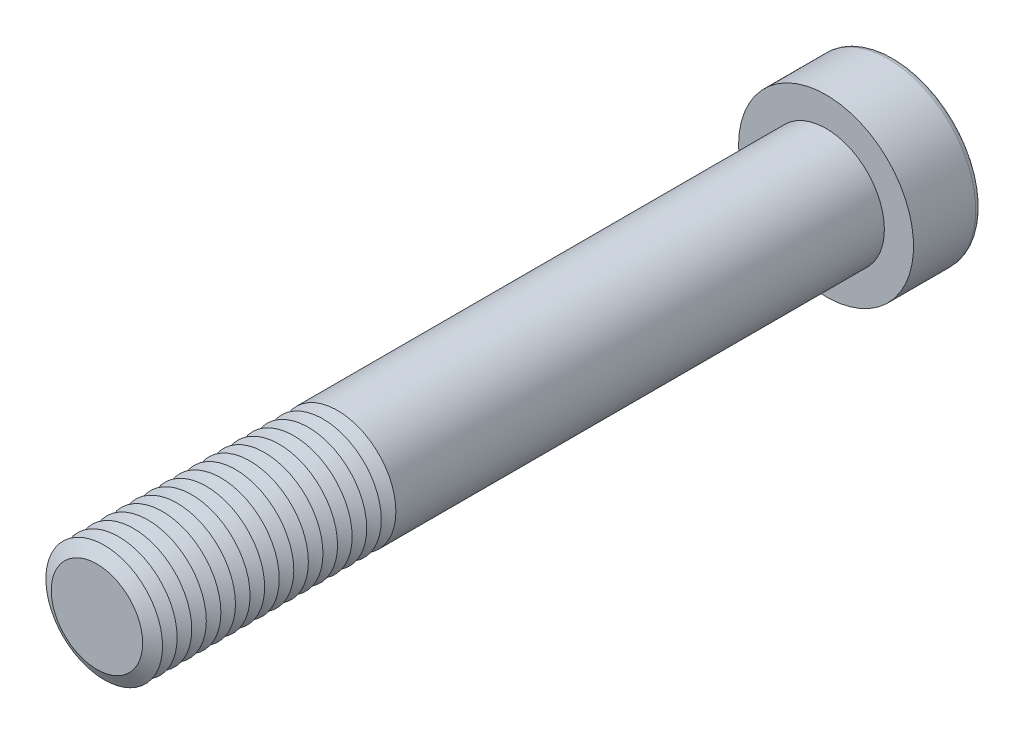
ISO-10303-21;
HEADER;
FILE_DESCRIPTION(('STEP AP214'),'2;1');
FILE_NAME('part.step','',(''),(''),'','','');
FILE_SCHEMA(('AUTOMOTIVE_DESIGN { 1 0 10303 214 1 1 1 1 }'));
ENDSEC;
DATA;
#1=APPLICATION_CONTEXT('core data for automotive mechanical design processes');
#2=APPLICATION_PROTOCOL_DEFINITION('international standard','automotive_design',2000,#1);
#3=PRODUCT_CONTEXT('',#1,'mechanical');
#4=PRODUCT('Part','Part','',(#3));
#5=PRODUCT_RELATED_PRODUCT_CATEGORY('part','',(#4));
#6=PRODUCT_DEFINITION_FORMATION('','',#4);
#7=PRODUCT_DEFINITION_CONTEXT('part definition',#1,'design');
#8=PRODUCT_DEFINITION('design','',#6,#7);
#9=PRODUCT_DEFINITION_SHAPE('','',#8);
#10=(LENGTH_UNIT() NAMED_UNIT(*) SI_UNIT(.MILLI.,.METRE.));
#11=(NAMED_UNIT(*) PLANE_ANGLE_UNIT() SI_UNIT($,.RADIAN.));
#12=(NAMED_UNIT(*) SI_UNIT($,.STERADIAN.) SOLID_ANGLE_UNIT());
#13=UNCERTAINTY_MEASURE_WITH_UNIT(LENGTH_MEASURE(1.E-05),#10,'distance_accuracy_value','');
#14=(GEOMETRIC_REPRESENTATION_CONTEXT(3) GLOBAL_UNCERTAINTY_ASSIGNED_CONTEXT((#13)) GLOBAL_UNIT_ASSIGNED_CONTEXT((#10,
#11,#12)) REPRESENTATION_CONTEXT('',''));
#15=CARTESIAN_POINT('',(0.,0.,0.));
#16=DIRECTION('',(0.,0.,1.));
#17=DIRECTION('',(1.,0.,0.));
#18=AXIS2_PLACEMENT_3D('',#15,#16,#17);
#19=CARTESIAN_POINT('',(0.,0.,139.5));
#20=DIRECTION('',(0.,0.,1.));
#21=DIRECTION('',(1.,0.,0.));
#22=AXIS2_PLACEMENT_3D('',#19,#20,#21);
#23=CONICAL_SURFACE('',#22,12.,1.0471975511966);
#24=CARTESIAN_POINT('',(0.,0.,138.));
#25=DIRECTION('',(0.,0.,1.));
#26=DIRECTION('',(1.,0.,0.));
#27=AXIS2_PLACEMENT_3D('',#24,#25,#26);
#28=CIRCLE('',#27,9.40192378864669);
#29=CARTESIAN_POINT('',(9.40192378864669,0.,138.));
#30=VERTEX_POINT('',#29);
#31=EDGE_CURVE('E313',#30,#30,#28,.T.);
#32=ORIENTED_EDGE('',*,*,#31,.T.);
#33=EDGE_LOOP('',(#32));
#34=FACE_BOUND('',#33,.T.);
#35=CARTESIAN_POINT('',(0.,0.,139.5));
#36=DIRECTION('',(0.,0.,1.));
#37=DIRECTION('',(1.,0.,0.));
#38=AXIS2_PLACEMENT_3D('',#35,#36,#37);
#39=CIRCLE('',#38,12.);
#40=CARTESIAN_POINT('',(12.,0.,139.5));
#41=VERTEX_POINT('',#40);
#42=EDGE_CURVE('E316',#41,#41,#39,.T.);
#43=ORIENTED_EDGE('',*,*,#42,.F.);
#44=EDGE_LOOP('',(#43));
#45=FACE_BOUND('',#44,.T.);
#46=ADVANCED_FACE('F39',(#34,#45),#23,.T.);
#47=CARTESIAN_POINT('',(0.,0.,138.));
#48=DIRECTION('',(0.,0.,-1.));
#49=DIRECTION('',(-1.,0.,0.));
#50=AXIS2_PLACEMENT_3D('',#47,#48,#49);
#51=CONICAL_SURFACE('',#50,9.40192378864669,1.0471975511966);
#52=CARTESIAN_POINT('',(0.,0.,136.5));
#53=DIRECTION('',(0.,0.,1.));
#54=DIRECTION('',(1.,0.,0.));
#55=AXIS2_PLACEMENT_3D('',#52,#53,#54);
#56=CIRCLE('',#55,12.);
#57=CARTESIAN_POINT('',(12.,0.,136.5));
#58=VERTEX_POINT('',#57);
#59=EDGE_CURVE('E324',#58,#58,#56,.T.);
#60=ORIENTED_EDGE('',*,*,#59,.T.);
#61=EDGE_LOOP('',(#60));
#62=FACE_BOUND('',#61,.T.);
#63=ORIENTED_EDGE('',*,*,#31,.F.);
#64=EDGE_LOOP('',(#63));
#65=FACE_BOUND('',#64,.T.);
#66=ADVANCED_FACE('F244',(#62,#65),#51,.T.);
#67=CARTESIAN_POINT('',(0.,0.,150.));
#68=DIRECTION('',(0.,0.,1.));
#69=DIRECTION('',(1.,0.,0.));
#70=AXIS2_PLACEMENT_3D('',#67,#68,#69);
#71=PLANE('',#70);
#72=CARTESIAN_POINT('',(0.,0.,150.));
#73=DIRECTION('',(0.,0.,1.));
#74=DIRECTION('',(1.,0.,0.));
#75=AXIS2_PLACEMENT_3D('',#72,#73,#74);
#76=CIRCLE('',#75,9.40192378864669);
#77=CARTESIAN_POINT('',(9.40192378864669,0.,150.));
#78=VERTEX_POINT('',#77);
#79=EDGE_CURVE('E174',#78,#78,#76,.T.);
#80=ORIENTED_EDGE('',*,*,#79,.T.);
#81=EDGE_LOOP('',(#80));
#82=FACE_BOUND('',#81,.T.);
#83=ADVANCED_FACE('F250',(#82),#71,.T.);
#84=CARTESIAN_POINT('',(0.,0.,150.));
#85=DIRECTION('',(0.,0.,-1.));
#86=DIRECTION('',(-1.,0.,0.));
#87=AXIS2_PLACEMENT_3D('',#84,#85,#86);
#88=CONICAL_SURFACE('',#87,9.40192378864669,1.0471975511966);
#89=CARTESIAN_POINT('',(0.,0.,148.5));
#90=DIRECTION('',(0.,0.,1.));
#91=DIRECTION('',(1.,0.,0.));
#92=AXIS2_PLACEMENT_3D('',#89,#90,#91);
#93=CIRCLE('',#92,12.);
#94=CARTESIAN_POINT('',(12.,0.,148.5));
#95=VERTEX_POINT('',#94);
#96=EDGE_CURVE('E290',#95,#95,#93,.T.);
#97=ORIENTED_EDGE('',*,*,#96,.T.);
#98=EDGE_LOOP('',(#97));
#99=FACE_BOUND('',#98,.T.);
#100=ORIENTED_EDGE('',*,*,#79,.F.);
#101=EDGE_LOOP('',(#100));
#102=FACE_BOUND('',#101,.T.);
#103=ADVANCED_FACE('F198',(#99,#102),#88,.T.);
#104=CARTESIAN_POINT('',(0.,0.,148.5));
#105=DIRECTION('',(0.,0.,1.));
#106=DIRECTION('',(1.,0.,0.));
#107=AXIS2_PLACEMENT_3D('',#104,#105,#106);
#108=CONICAL_SURFACE('',#107,12.,1.0471975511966);
#109=CARTESIAN_POINT('',(0.,0.,147.));
#110=DIRECTION('',(0.,0.,1.));
#111=DIRECTION('',(1.,0.,0.));
#112=AXIS2_PLACEMENT_3D('',#109,#110,#111);
#113=CIRCLE('',#112,9.40192378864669);
#114=CARTESIAN_POINT('',(9.40192378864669,0.,147.));
#115=VERTEX_POINT('',#114);
#116=EDGE_CURVE('E287',#115,#115,#113,.T.);
#117=ORIENTED_EDGE('',*,*,#116,.T.);
#118=EDGE_LOOP('',(#117));
#119=FACE_BOUND('',#118,.T.);
#120=ORIENTED_EDGE('',*,*,#96,.F.);
#121=EDGE_LOOP('',(#120));
#122=FACE_BOUND('',#121,.T.);
#123=ADVANCED_FACE('F276',(#119,#122),#108,.T.);
#124=CARTESIAN_POINT('',(0.,0.,147.));
#125=DIRECTION('',(0.,0.,-1.));
#126=DIRECTION('',(-1.,0.,0.));
#127=AXIS2_PLACEMENT_3D('',#124,#125,#126);
#128=CONICAL_SURFACE('',#127,9.40192378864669,1.0471975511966);
#129=CARTESIAN_POINT('',(0.,0.,145.5));
#130=DIRECTION('',(0.,0.,1.));
#131=DIRECTION('',(1.,0.,0.));
#132=AXIS2_PLACEMENT_3D('',#129,#130,#131);
#133=CIRCLE('',#132,12.);
#134=CARTESIAN_POINT('',(12.,0.,145.5));
#135=VERTEX_POINT('',#134);
#136=EDGE_CURVE('E299',#135,#135,#133,.T.);
#137=ORIENTED_EDGE('',*,*,#136,.T.);
#138=EDGE_LOOP('',(#137));
#139=FACE_BOUND('',#138,.T.);
#140=ORIENTED_EDGE('',*,*,#116,.F.);
#141=EDGE_LOOP('',(#140));
#142=FACE_BOUND('',#141,.T.);
#143=ADVANCED_FACE('F273',(#139,#142),#128,.T.);
#144=CARTESIAN_POINT('',(0.,0.,145.5));
#145=DIRECTION('',(0.,0.,1.));
#146=DIRECTION('',(1.,0.,0.));
#147=AXIS2_PLACEMENT_3D('',#144,#145,#146);
#148=CONICAL_SURFACE('',#147,12.,1.0471975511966);
#149=CARTESIAN_POINT('',(0.,0.,144.));
#150=DIRECTION('',(0.,0.,1.));
#151=DIRECTION('',(1.,0.,0.));
#152=AXIS2_PLACEMENT_3D('',#149,#150,#151);
#153=CIRCLE('',#152,9.40192378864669);
#154=CARTESIAN_POINT('',(9.40192378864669,0.,144.));
#155=VERTEX_POINT('',#154);
#156=EDGE_CURVE('E292',#155,#155,#153,.T.);
#157=ORIENTED_EDGE('',*,*,#156,.T.);
#158=EDGE_LOOP('',(#157));
#159=FACE_BOUND('',#158,.T.);
#160=ORIENTED_EDGE('',*,*,#136,.F.);
#161=EDGE_LOOP('',(#160));
#162=FACE_BOUND('',#161,.T.);
#163=ADVANCED_FACE('F269',(#159,#162),#148,.T.);
#164=CARTESIAN_POINT('',(0.,0.,144.));
#165=DIRECTION('',(0.,0.,-1.));
#166=DIRECTION('',(-1.,0.,0.));
#167=AXIS2_PLACEMENT_3D('',#164,#165,#166);
#168=CONICAL_SURFACE('',#167,9.40192378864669,1.0471975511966);
#169=CARTESIAN_POINT('',(0.,0.,142.5));
#170=DIRECTION('',(0.,0.,1.));
#171=DIRECTION('',(1.,0.,0.));
#172=AXIS2_PLACEMENT_3D('',#169,#170,#171);
#173=CIRCLE('',#172,12.);
#174=CARTESIAN_POINT('',(12.,0.,142.5));
#175=VERTEX_POINT('',#174);
#176=EDGE_CURVE('E309',#175,#175,#173,.T.);
#177=ORIENTED_EDGE('',*,*,#176,.T.);
#178=EDGE_LOOP('',(#177));
#179=FACE_BOUND('',#178,.T.);
#180=ORIENTED_EDGE('',*,*,#156,.F.);
#181=EDGE_LOOP('',(#180));
#182=FACE_BOUND('',#181,.T.);
#183=ADVANCED_FACE('F265',(#179,#182),#168,.T.);
#184=CARTESIAN_POINT('',(0.,0.,142.5));
#185=DIRECTION('',(0.,0.,1.));
#186=DIRECTION('',(1.,0.,0.));
#187=AXIS2_PLACEMENT_3D('',#184,#185,#186);
#188=CONICAL_SURFACE('',#187,12.,1.0471975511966);
#189=CARTESIAN_POINT('',(0.,0.,141.));
#190=DIRECTION('',(0.,0.,1.));
#191=DIRECTION('',(1.,0.,0.));
#192=AXIS2_PLACEMENT_3D('',#189,#190,#191);
#193=CIRCLE('',#192,9.40192378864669);
#194=CARTESIAN_POINT('',(9.40192378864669,0.,141.));
#195=VERTEX_POINT('',#194);
#196=EDGE_CURVE('E305',#195,#195,#193,.T.);
#197=ORIENTED_EDGE('',*,*,#196,.T.);
#198=EDGE_LOOP('',(#197));
#199=FACE_BOUND('',#198,.T.);
#200=ORIENTED_EDGE('',*,*,#176,.F.);
#201=EDGE_LOOP('',(#200));
#202=FACE_BOUND('',#201,.T.);
#203=ADVANCED_FACE('F261',(#199,#202),#188,.T.);
#204=CARTESIAN_POINT('',(0.,0.,141.));
#205=DIRECTION('',(0.,0.,-1.));
#206=DIRECTION('',(-1.,0.,0.));
#207=AXIS2_PLACEMENT_3D('',#204,#205,#206);
#208=CONICAL_SURFACE('',#207,9.40192378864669,1.0471975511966);
#209=ORIENTED_EDGE('',*,*,#42,.T.);
#210=EDGE_LOOP('',(#209));
#211=FACE_BOUND('',#210,.T.);
#212=ORIENTED_EDGE('',*,*,#196,.F.);
#213=EDGE_LOOP('',(#212));
#214=FACE_BOUND('',#213,.T.);
#215=ADVANCED_FACE('F257',(#211,#214),#208,.T.);
#216=CARTESIAN_POINT('',(0.,0.,136.5));
#217=DIRECTION('',(0.,0.,1.));
#218=DIRECTION('',(1.,0.,0.));
#219=AXIS2_PLACEMENT_3D('',#216,#217,#218);
#220=CONICAL_SURFACE('',#219,12.,1.0471975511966);
#221=CARTESIAN_POINT('',(0.,0.,135.));
#222=DIRECTION('',(0.,0.,1.));
#223=DIRECTION('',(1.,0.,0.));
#224=AXIS2_PLACEMENT_3D('',#221,#222,#223);
#225=CIRCLE('',#224,9.40192378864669);
#226=CARTESIAN_POINT('',(9.40192378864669,0.,135.));
#227=VERTEX_POINT('',#226);
#228=EDGE_CURVE('E320',#227,#227,#225,.T.);
#229=ORIENTED_EDGE('',*,*,#228,.T.);
#230=EDGE_LOOP('',(#229));
#231=FACE_BOUND('',#230,.T.);
#232=ORIENTED_EDGE('',*,*,#59,.F.);
#233=EDGE_LOOP('',(#232));
#234=FACE_BOUND('',#233,.T.);
#235=ADVANCED_FACE('F260',(#231,#234),#220,.T.);
#236=CARTESIAN_POINT('',(0.,0.,135.));
#237=DIRECTION('',(0.,0.,-1.));
#238=DIRECTION('',(-1.,0.,0.));
#239=AXIS2_PLACEMENT_3D('',#236,#237,#238);
#240=CONICAL_SURFACE('',#239,9.40192378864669,1.0471975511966);
#241=CARTESIAN_POINT('',(0.,0.,133.5));
#242=DIRECTION('',(0.,0.,1.));
#243=DIRECTION('',(1.,0.,0.));
#244=AXIS2_PLACEMENT_3D('',#241,#242,#243);
#245=CIRCLE('',#244,12.);
#246=CARTESIAN_POINT('',(12.,0.,133.5));
#247=VERTEX_POINT('',#246);
#248=EDGE_CURVE('E332',#247,#247,#245,.T.);
#249=ORIENTED_EDGE('',*,*,#248,.T.);
#250=EDGE_LOOP('',(#249));
#251=FACE_BOUND('',#250,.T.);
#252=ORIENTED_EDGE('',*,*,#228,.F.);
#253=EDGE_LOOP('',(#252));
#254=FACE_BOUND('',#253,.T.);
#255=ADVANCED_FACE('F513',(#251,#254),#240,.T.);
#256=CARTESIAN_POINT('',(0.,0.,133.5));
#257=DIRECTION('',(0.,0.,1.));
#258=DIRECTION('',(1.,0.,0.));
#259=AXIS2_PLACEMENT_3D('',#256,#257,#258);
#260=CONICAL_SURFACE('',#259,12.,1.0471975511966);
#261=CARTESIAN_POINT('',(0.,0.,132.));
#262=DIRECTION('',(0.,0.,1.));
#263=DIRECTION('',(1.,0.,0.));
#264=AXIS2_PLACEMENT_3D('',#261,#262,#263);
#265=CIRCLE('',#264,9.40192378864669);
#266=CARTESIAN_POINT('',(9.40192378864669,0.,132.));
#267=VERTEX_POINT('',#266);
#268=EDGE_CURVE('E328',#267,#267,#265,.T.);
#269=ORIENTED_EDGE('',*,*,#268,.T.);
#270=EDGE_LOOP('',(#269));
#271=FACE_BOUND('',#270,.T.);
#272=ORIENTED_EDGE('',*,*,#248,.F.);
#273=EDGE_LOOP('',(#272));
#274=FACE_BOUND('',#273,.T.);
#275=ADVANCED_FACE('F509',(#271,#274),#260,.T.);
#276=CARTESIAN_POINT('',(0.,0.,132.));
#277=DIRECTION('',(0.,0.,-1.));
#278=DIRECTION('',(-1.,0.,0.));
#279=AXIS2_PLACEMENT_3D('',#276,#277,#278);
#280=CONICAL_SURFACE('',#279,9.40192378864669,1.0471975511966);
#281=CARTESIAN_POINT('',(0.,0.,130.5));
#282=DIRECTION('',(0.,0.,1.));
#283=DIRECTION('',(1.,0.,0.));
#284=AXIS2_PLACEMENT_3D('',#281,#282,#283);
#285=CIRCLE('',#284,12.);
#286=CARTESIAN_POINT('',(12.,0.,130.5));
#287=VERTEX_POINT('',#286);
#288=EDGE_CURVE('E340',#287,#287,#285,.T.);
#289=ORIENTED_EDGE('',*,*,#288,.T.);
#290=EDGE_LOOP('',(#289));
#291=FACE_BOUND('',#290,.T.);
#292=ORIENTED_EDGE('',*,*,#268,.F.);
#293=EDGE_LOOP('',(#292));
#294=FACE_BOUND('',#293,.T.);
#295=ADVANCED_FACE('F505',(#291,#294),#280,.T.);
#296=CARTESIAN_POINT('',(0.,0.,130.5));
#297=DIRECTION('',(0.,0.,1.));
#298=DIRECTION('',(1.,0.,0.));
#299=AXIS2_PLACEMENT_3D('',#296,#297,#298);
#300=CONICAL_SURFACE('',#299,12.,1.0471975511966);
#301=CARTESIAN_POINT('',(0.,0.,129.));
#302=DIRECTION('',(0.,0.,1.));
#303=DIRECTION('',(1.,0.,0.));
#304=AXIS2_PLACEMENT_3D('',#301,#302,#303);
#305=CIRCLE('',#304,9.40192378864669);
#306=CARTESIAN_POINT('',(9.40192378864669,0.,129.));
#307=VERTEX_POINT('',#306);
#308=EDGE_CURVE('E336',#307,#307,#305,.T.);
#309=ORIENTED_EDGE('',*,*,#308,.T.);
#310=EDGE_LOOP('',(#309));
#311=FACE_BOUND('',#310,.T.);
#312=ORIENTED_EDGE('',*,*,#288,.F.);
#313=EDGE_LOOP('',(#312));
#314=FACE_BOUND('',#313,.T.);
#315=ADVANCED_FACE('F501',(#311,#314),#300,.T.);
#316=CARTESIAN_POINT('',(0.,0.,129.));
#317=DIRECTION('',(0.,0.,-1.));
#318=DIRECTION('',(-1.,0.,0.));
#319=AXIS2_PLACEMENT_3D('',#316,#317,#318);
#320=CONICAL_SURFACE('',#319,9.40192378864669,1.0471975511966);
#321=CARTESIAN_POINT('',(0.,0.,127.5));
#322=DIRECTION('',(0.,0.,1.));
#323=DIRECTION('',(1.,0.,0.));
#324=AXIS2_PLACEMENT_3D('',#321,#322,#323);
#325=CIRCLE('',#324,12.);
#326=CARTESIAN_POINT('',(12.,0.,127.5));
#327=VERTEX_POINT('',#326);
#328=EDGE_CURVE('E348',#327,#327,#325,.T.);
#329=ORIENTED_EDGE('',*,*,#328,.T.);
#330=EDGE_LOOP('',(#329));
#331=FACE_BOUND('',#330,.T.);
#332=ORIENTED_EDGE('',*,*,#308,.F.);
#333=EDGE_LOOP('',(#332));
#334=FACE_BOUND('',#333,.T.);
#335=ADVANCED_FACE('F497',(#331,#334),#320,.T.);
#336=CARTESIAN_POINT('',(0.,0.,127.5));
#337=DIRECTION('',(0.,0.,1.));
#338=DIRECTION('',(1.,0.,0.));
#339=AXIS2_PLACEMENT_3D('',#336,#337,#338);
#340=CONICAL_SURFACE('',#339,12.,1.0471975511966);
#341=CARTESIAN_POINT('',(0.,0.,126.));
#342=DIRECTION('',(0.,0.,1.));
#343=DIRECTION('',(1.,0.,0.));
#344=AXIS2_PLACEMENT_3D('',#341,#342,#343);
#345=CIRCLE('',#344,9.40192378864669);
#346=CARTESIAN_POINT('',(9.40192378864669,0.,126.));
#347=VERTEX_POINT('',#346);
#348=EDGE_CURVE('E344',#347,#347,#345,.T.);
#349=ORIENTED_EDGE('',*,*,#348,.T.);
#350=EDGE_LOOP('',(#349));
#351=FACE_BOUND('',#350,.T.);
#352=ORIENTED_EDGE('',*,*,#328,.F.);
#353=EDGE_LOOP('',(#352));
#354=FACE_BOUND('',#353,.T.);
#355=ADVANCED_FACE('F493',(#351,#354),#340,.T.);
#356=CARTESIAN_POINT('',(0.,0.,126.));
#357=DIRECTION('',(0.,0.,-1.));
#358=DIRECTION('',(-1.,0.,0.));
#359=AXIS2_PLACEMENT_3D('',#356,#357,#358);
#360=CONICAL_SURFACE('',#359,9.40192378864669,1.0471975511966);
#361=CARTESIAN_POINT('',(0.,0.,124.5));
#362=DIRECTION('',(0.,0.,1.));
#363=DIRECTION('',(1.,0.,0.));
#364=AXIS2_PLACEMENT_3D('',#361,#362,#363);
#365=CIRCLE('',#364,12.);
#366=CARTESIAN_POINT('',(12.,0.,124.5));
#367=VERTEX_POINT('',#366);
#368=EDGE_CURVE('E356',#367,#367,#365,.T.);
#369=ORIENTED_EDGE('',*,*,#368,.T.);
#370=EDGE_LOOP('',(#369));
#371=FACE_BOUND('',#370,.T.);
#372=ORIENTED_EDGE('',*,*,#348,.F.);
#373=EDGE_LOOP('',(#372));
#374=FACE_BOUND('',#373,.T.);
#375=ADVANCED_FACE('F489',(#371,#374),#360,.T.);
#376=CARTESIAN_POINT('',(0.,0.,124.5));
#377=DIRECTION('',(0.,0.,1.));
#378=DIRECTION('',(1.,0.,0.));
#379=AXIS2_PLACEMENT_3D('',#376,#377,#378);
#380=CONICAL_SURFACE('',#379,12.,1.0471975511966);
#381=CARTESIAN_POINT('',(0.,0.,123.));
#382=DIRECTION('',(0.,0.,1.));
#383=DIRECTION('',(1.,0.,0.));
#384=AXIS2_PLACEMENT_3D('',#381,#382,#383);
#385=CIRCLE('',#384,9.40192378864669);
#386=CARTESIAN_POINT('',(9.40192378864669,0.,123.));
#387=VERTEX_POINT('',#386);
#388=EDGE_CURVE('E352',#387,#387,#385,.T.);
#389=ORIENTED_EDGE('',*,*,#388,.T.);
#390=EDGE_LOOP('',(#389));
#391=FACE_BOUND('',#390,.T.);
#392=ORIENTED_EDGE('',*,*,#368,.F.);
#393=EDGE_LOOP('',(#392));
#394=FACE_BOUND('',#393,.T.);
#395=ADVANCED_FACE('F485',(#391,#394),#380,.T.);
#396=CARTESIAN_POINT('',(0.,0.,123.));
#397=DIRECTION('',(0.,0.,-1.));
#398=DIRECTION('',(-1.,0.,0.));
#399=AXIS2_PLACEMENT_3D('',#396,#397,#398);
#400=CONICAL_SURFACE('',#399,9.40192378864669,1.0471975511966);
#401=CARTESIAN_POINT('',(0.,0.,121.5));
#402=DIRECTION('',(0.,0.,1.));
#403=DIRECTION('',(1.,0.,0.));
#404=AXIS2_PLACEMENT_3D('',#401,#402,#403);
#405=CIRCLE('',#404,12.);
#406=CARTESIAN_POINT('',(12.,0.,121.5));
#407=VERTEX_POINT('',#406);
#408=EDGE_CURVE('E364',#407,#407,#405,.T.);
#409=ORIENTED_EDGE('',*,*,#408,.T.);
#410=EDGE_LOOP('',(#409));
#411=FACE_BOUND('',#410,.T.);
#412=ORIENTED_EDGE('',*,*,#388,.F.);
#413=EDGE_LOOP('',(#412));
#414=FACE_BOUND('',#413,.T.);
#415=ADVANCED_FACE('F481',(#411,#414),#400,.T.);
#416=CARTESIAN_POINT('',(0.,0.,121.5));
#417=DIRECTION('',(0.,0.,1.));
#418=DIRECTION('',(1.,0.,0.));
#419=AXIS2_PLACEMENT_3D('',#416,#417,#418);
#420=CONICAL_SURFACE('',#419,12.,1.0471975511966);
#421=CARTESIAN_POINT('',(0.,0.,120.));
#422=DIRECTION('',(0.,0.,1.));
#423=DIRECTION('',(1.,0.,0.));
#424=AXIS2_PLACEMENT_3D('',#421,#422,#423);
#425=CIRCLE('',#424,9.40192378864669);
#426=CARTESIAN_POINT('',(9.40192378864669,0.,120.));
#427=VERTEX_POINT('',#426);
#428=EDGE_CURVE('E360',#427,#427,#425,.T.);
#429=ORIENTED_EDGE('',*,*,#428,.T.);
#430=EDGE_LOOP('',(#429));
#431=FACE_BOUND('',#430,.T.);
#432=ORIENTED_EDGE('',*,*,#408,.F.);
#433=EDGE_LOOP('',(#432));
#434=FACE_BOUND('',#433,.T.);
#435=ADVANCED_FACE('F477',(#431,#434),#420,.T.);
#436=CARTESIAN_POINT('',(0.,0.,120.));
#437=DIRECTION('',(0.,0.,-1.));
#438=DIRECTION('',(-1.,0.,0.));
#439=AXIS2_PLACEMENT_3D('',#436,#437,#438);
#440=CONICAL_SURFACE('',#439,9.40192378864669,1.0471975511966);
#441=CARTESIAN_POINT('',(0.,0.,118.5));
#442=DIRECTION('',(0.,0.,1.));
#443=DIRECTION('',(1.,0.,0.));
#444=AXIS2_PLACEMENT_3D('',#441,#442,#443);
#445=CIRCLE('',#444,12.);
#446=CARTESIAN_POINT('',(12.,0.,118.5));
#447=VERTEX_POINT('',#446);
#448=EDGE_CURVE('E371',#447,#447,#445,.T.);
#449=ORIENTED_EDGE('',*,*,#448,.T.);
#450=EDGE_LOOP('',(#449));
#451=FACE_BOUND('',#450,.T.);
#452=ORIENTED_EDGE('',*,*,#428,.F.);
#453=EDGE_LOOP('',(#452));
#454=FACE_BOUND('',#453,.T.);
#455=ADVANCED_FACE('F473',(#451,#454),#440,.T.);
#456=CARTESIAN_POINT('',(0.,0.,118.5));
#457=DIRECTION('',(0.,0.,1.));
#458=DIRECTION('',(1.,0.,0.));
#459=AXIS2_PLACEMENT_3D('',#456,#457,#458);
#460=CONICAL_SURFACE('',#459,12.,1.0471975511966);
#461=CARTESIAN_POINT('',(0.,0.,117.));
#462=DIRECTION('',(0.,0.,1.));
#463=DIRECTION('',(1.,0.,0.));
#464=AXIS2_PLACEMENT_3D('',#461,#462,#463);
#465=CIRCLE('',#464,9.40192378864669);
#466=CARTESIAN_POINT('',(9.40192378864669,0.,117.));
#467=VERTEX_POINT('',#466);
#468=EDGE_CURVE('E368',#467,#467,#465,.T.);
#469=ORIENTED_EDGE('',*,*,#468,.T.);
#470=EDGE_LOOP('',(#469));
#471=FACE_BOUND('',#470,.T.);
#472=ORIENTED_EDGE('',*,*,#448,.F.);
#473=EDGE_LOOP('',(#472));
#474=FACE_BOUND('',#473,.T.);
#475=ADVANCED_FACE('F469',(#471,#474),#460,.T.);
#476=CARTESIAN_POINT('',(0.,0.,117.));
#477=DIRECTION('',(0.,0.,-1.));
#478=DIRECTION('',(-1.,0.,0.));
#479=AXIS2_PLACEMENT_3D('',#476,#477,#478);
#480=CONICAL_SURFACE('',#479,9.40192378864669,1.0471975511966);
#481=CARTESIAN_POINT('',(0.,0.,115.5));
#482=DIRECTION('',(0.,0.,1.));
#483=DIRECTION('',(1.,0.,0.));
#484=AXIS2_PLACEMENT_3D('',#481,#482,#483);
#485=CIRCLE('',#484,12.);
#486=CARTESIAN_POINT('',(12.,0.,115.5));
#487=VERTEX_POINT('',#486);
#488=EDGE_CURVE('E379',#487,#487,#485,.T.);
#489=ORIENTED_EDGE('',*,*,#488,.T.);
#490=EDGE_LOOP('',(#489));
#491=FACE_BOUND('',#490,.T.);
#492=ORIENTED_EDGE('',*,*,#468,.F.);
#493=EDGE_LOOP('',(#492));
#494=FACE_BOUND('',#493,.T.);
#495=ADVANCED_FACE('F465',(#491,#494),#480,.T.);
#496=CARTESIAN_POINT('',(0.,0.,115.5));
#497=DIRECTION('',(0.,0.,1.));
#498=DIRECTION('',(1.,0.,0.));
#499=AXIS2_PLACEMENT_3D('',#496,#497,#498);
#500=CONICAL_SURFACE('',#499,12.,1.0471975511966);
#501=CARTESIAN_POINT('',(0.,0.,114.));
#502=DIRECTION('',(0.,0.,1.));
#503=DIRECTION('',(1.,0.,0.));
#504=AXIS2_PLACEMENT_3D('',#501,#502,#503);
#505=CIRCLE('',#504,9.40192378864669);
#506=CARTESIAN_POINT('',(9.40192378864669,0.,114.));
#507=VERTEX_POINT('',#506);
#508=EDGE_CURVE('E375',#507,#507,#505,.T.);
#509=ORIENTED_EDGE('',*,*,#508,.T.);
#510=EDGE_LOOP('',(#509));
#511=FACE_BOUND('',#510,.T.);
#512=ORIENTED_EDGE('',*,*,#488,.F.);
#513=EDGE_LOOP('',(#512));
#514=FACE_BOUND('',#513,.T.);
#515=ADVANCED_FACE('F461',(#511,#514),#500,.T.);
#516=CARTESIAN_POINT('',(0.,0.,114.));
#517=DIRECTION('',(0.,0.,-1.));
#518=DIRECTION('',(-1.,0.,0.));
#519=AXIS2_PLACEMENT_3D('',#516,#517,#518);
#520=CONICAL_SURFACE('',#519,9.40192378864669,1.0471975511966);
#521=CARTESIAN_POINT('',(0.,0.,112.5));
#522=DIRECTION('',(0.,0.,1.));
#523=DIRECTION('',(1.,0.,0.));
#524=AXIS2_PLACEMENT_3D('',#521,#522,#523);
#525=CIRCLE('',#524,12.);
#526=CARTESIAN_POINT('',(12.,0.,112.5));
#527=VERTEX_POINT('',#526);
#528=EDGE_CURVE('E387',#527,#527,#525,.T.);
#529=ORIENTED_EDGE('',*,*,#528,.T.);
#530=EDGE_LOOP('',(#529));
#531=FACE_BOUND('',#530,.T.);
#532=ORIENTED_EDGE('',*,*,#508,.F.);
#533=EDGE_LOOP('',(#532));
#534=FACE_BOUND('',#533,.T.);
#535=ADVANCED_FACE('F457',(#531,#534),#520,.T.);
#536=CARTESIAN_POINT('',(0.,0.,112.5));
#537=DIRECTION('',(0.,0.,1.));
#538=DIRECTION('',(1.,0.,0.));
#539=AXIS2_PLACEMENT_3D('',#536,#537,#538);
#540=CONICAL_SURFACE('',#539,12.,1.0471975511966);
#541=CARTESIAN_POINT('',(0.,0.,111.));
#542=DIRECTION('',(0.,0.,1.));
#543=DIRECTION('',(1.,0.,0.));
#544=AXIS2_PLACEMENT_3D('',#541,#542,#543);
#545=CIRCLE('',#544,9.40192378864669);
#546=CARTESIAN_POINT('',(9.40192378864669,0.,111.));
#547=VERTEX_POINT('',#546);
#548=EDGE_CURVE('E383',#547,#547,#545,.T.);
#549=ORIENTED_EDGE('',*,*,#548,.T.);
#550=EDGE_LOOP('',(#549));
#551=FACE_BOUND('',#550,.T.);
#552=ORIENTED_EDGE('',*,*,#528,.F.);
#553=EDGE_LOOP('',(#552));
#554=FACE_BOUND('',#553,.T.);
#555=ADVANCED_FACE('F453',(#551,#554),#540,.T.);
#556=CARTESIAN_POINT('',(0.,0.,111.));
#557=DIRECTION('',(0.,0.,-1.));
#558=DIRECTION('',(-1.,0.,0.));
#559=AXIS2_PLACEMENT_3D('',#556,#557,#558);
#560=CONICAL_SURFACE('',#559,9.40192378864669,1.0471975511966);
#561=CARTESIAN_POINT('',(0.,0.,109.5));
#562=DIRECTION('',(0.,0.,1.));
#563=DIRECTION('',(1.,0.,0.));
#564=AXIS2_PLACEMENT_3D('',#561,#562,#563);
#565=CIRCLE('',#564,12.);
#566=CARTESIAN_POINT('',(12.,0.,109.5));
#567=VERTEX_POINT('',#566);
#568=EDGE_CURVE('E395',#567,#567,#565,.T.);
#569=ORIENTED_EDGE('',*,*,#568,.T.);
#570=EDGE_LOOP('',(#569));
#571=FACE_BOUND('',#570,.T.);
#572=ORIENTED_EDGE('',*,*,#548,.F.);
#573=EDGE_LOOP('',(#572));
#574=FACE_BOUND('',#573,.T.);
#575=ADVANCED_FACE('F449',(#571,#574),#560,.T.);
#576=CARTESIAN_POINT('',(0.,0.,109.5));
#577=DIRECTION('',(0.,0.,1.));
#578=DIRECTION('',(1.,0.,0.));
#579=AXIS2_PLACEMENT_3D('',#576,#577,#578);
#580=CONICAL_SURFACE('',#579,12.,1.0471975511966);
#581=CARTESIAN_POINT('',(0.,0.,108.));
#582=DIRECTION('',(0.,0.,1.));
#583=DIRECTION('',(1.,0.,0.));
#584=AXIS2_PLACEMENT_3D('',#581,#582,#583);
#585=CIRCLE('',#584,9.40192378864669);
#586=CARTESIAN_POINT('',(9.40192378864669,0.,108.));
#587=VERTEX_POINT('',#586);
#588=EDGE_CURVE('E391',#587,#587,#585,.T.);
#589=ORIENTED_EDGE('',*,*,#588,.T.);
#590=EDGE_LOOP('',(#589));
#591=FACE_BOUND('',#590,.T.);
#592=ORIENTED_EDGE('',*,*,#568,.F.);
#593=EDGE_LOOP('',(#592));
#594=FACE_BOUND('',#593,.T.);
#595=ADVANCED_FACE('F445',(#591,#594),#580,.T.);
#596=CARTESIAN_POINT('',(0.,0.,108.));
#597=DIRECTION('',(0.,0.,-1.));
#598=DIRECTION('',(-1.,0.,0.));
#599=AXIS2_PLACEMENT_3D('',#596,#597,#598);
#600=CONICAL_SURFACE('',#599,9.40192378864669,1.0471975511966);
#601=CARTESIAN_POINT('',(0.,0.,106.5));
#602=DIRECTION('',(0.,0.,1.));
#603=DIRECTION('',(1.,0.,0.));
#604=AXIS2_PLACEMENT_3D('',#601,#602,#603);
#605=CIRCLE('',#604,12.);
#606=CARTESIAN_POINT('',(12.,0.,106.5));
#607=VERTEX_POINT('',#606);
#608=EDGE_CURVE('E403',#607,#607,#605,.T.);
#609=ORIENTED_EDGE('',*,*,#608,.T.);
#610=EDGE_LOOP('',(#609));
#611=FACE_BOUND('',#610,.T.);
#612=ORIENTED_EDGE('',*,*,#588,.F.);
#613=EDGE_LOOP('',(#612));
#614=FACE_BOUND('',#613,.T.);
#615=ADVANCED_FACE('F441',(#611,#614),#600,.T.);
#616=CARTESIAN_POINT('',(0.,0.,106.5));
#617=DIRECTION('',(0.,0.,1.));
#618=DIRECTION('',(1.,0.,0.));
#619=AXIS2_PLACEMENT_3D('',#616,#617,#618);
#620=CONICAL_SURFACE('',#619,12.,1.0471975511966);
#621=CARTESIAN_POINT('',(0.,0.,105.));
#622=DIRECTION('',(0.,0.,1.));
#623=DIRECTION('',(1.,0.,0.));
#624=AXIS2_PLACEMENT_3D('',#621,#622,#623);
#625=CIRCLE('',#624,9.40192378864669);
#626=CARTESIAN_POINT('',(9.40192378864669,0.,105.));
#627=VERTEX_POINT('',#626);
#628=EDGE_CURVE('E399',#627,#627,#625,.T.);
#629=ORIENTED_EDGE('',*,*,#628,.T.);
#630=EDGE_LOOP('',(#629));
#631=FACE_BOUND('',#630,.T.);
#632=ORIENTED_EDGE('',*,*,#608,.F.);
#633=EDGE_LOOP('',(#632));
#634=FACE_BOUND('',#633,.T.);
#635=ADVANCED_FACE('F436',(#631,#634),#620,.T.);
#636=CARTESIAN_POINT('',(0.,0.,105.));
#637=DIRECTION('',(0.,0.,-1.));
#638=DIRECTION('',(-1.,0.,0.));
#639=AXIS2_PLACEMENT_3D('',#636,#637,#638);
#640=CONICAL_SURFACE('',#639,9.40192378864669,1.0471975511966);
#641=CARTESIAN_POINT('',(0.,0.,103.5));
#642=DIRECTION('',(0.,0.,1.));
#643=DIRECTION('',(1.,0.,0.));
#644=AXIS2_PLACEMENT_3D('',#641,#642,#643);
#645=CIRCLE('',#644,12.);
#646=CARTESIAN_POINT('',(12.,0.,103.5));
#647=VERTEX_POINT('',#646);
#648=EDGE_CURVE('E415',#647,#647,#645,.T.);
#649=ORIENTED_EDGE('',*,*,#648,.T.);
#650=EDGE_LOOP('',(#649));
#651=FACE_BOUND('',#650,.T.);
#652=ORIENTED_EDGE('',*,*,#628,.F.);
#653=EDGE_LOOP('',(#652));
#654=FACE_BOUND('',#653,.T.);
#655=ADVANCED_FACE('F422',(#651,#654),#640,.T.);
#656=CARTESIAN_POINT('',(0.,0.,103.5));
#657=DIRECTION('',(0.,0.,1.));
#658=DIRECTION('',(1.,0.,0.));
#659=AXIS2_PLACEMENT_3D('',#656,#657,#658);
#660=CONICAL_SURFACE('',#659,12.,1.0471975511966);
#661=CARTESIAN_POINT('',(0.,0.,102.));
#662=DIRECTION('',(0.,0.,1.));
#663=DIRECTION('',(1.,0.,0.));
#664=AXIS2_PLACEMENT_3D('',#661,#662,#663);
#665=CIRCLE('',#664,9.40192378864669);
#666=CARTESIAN_POINT('',(9.40192378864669,0.,102.));
#667=VERTEX_POINT('',#666);
#668=EDGE_CURVE('E407',#667,#667,#665,.T.);
#669=ORIENTED_EDGE('',*,*,#668,.T.);
#670=EDGE_LOOP('',(#669));
#671=FACE_BOUND('',#670,.T.);
#672=ORIENTED_EDGE('',*,*,#648,.F.);
#673=EDGE_LOOP('',(#672));
#674=FACE_BOUND('',#673,.T.);
#675=ADVANCED_FACE('F425',(#671,#674),#660,.T.);
#676=CARTESIAN_POINT('',(0.,0.,102.));
#677=DIRECTION('',(0.,0.,-1.));
#678=DIRECTION('',(-1.,0.,0.));
#679=AXIS2_PLACEMENT_3D('',#676,#677,#678);
#680=CONICAL_SURFACE('',#679,9.40192378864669,1.0471975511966);
#681=CARTESIAN_POINT('',(0.,0.,100.5));
#682=DIRECTION('',(0.,0.,1.));
#683=DIRECTION('',(1.,0.,0.));
#684=AXIS2_PLACEMENT_3D('',#681,#682,#683);
#685=CIRCLE('',#684,12.);
#686=CARTESIAN_POINT('',(12.,0.,100.5));
#687=VERTEX_POINT('',#686);
#688=EDGE_CURVE('E411',#687,#687,#685,.T.);
#689=ORIENTED_EDGE('',*,*,#688,.T.);
#690=EDGE_LOOP('',(#689));
#691=FACE_BOUND('',#690,.T.);
#692=ORIENTED_EDGE('',*,*,#668,.F.);
#693=EDGE_LOOP('',(#692));
#694=FACE_BOUND('',#693,.T.);
#695=ADVANCED_FACE('F427',(#691,#694),#680,.T.);
#696=CARTESIAN_POINT('',(0.,0.,0.25));
#697=DIRECTION('',(0.,0.,-1.));
#698=DIRECTION('',(-1.,0.,0.));
#699=AXIS2_PLACEMENT_3D('',#696,#697,#698);
#700=CONICAL_SURFACE('',#699,9.5,1.0471975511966);
#701=CARTESIAN_POINT('',(0.,0.,5.73482755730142));
#702=VERTEX_POINT('',#701);
#703=VERTEX_LOOP('',#702);
#704=FACE_BOUND('',#703,.T.);
#705=CARTESIAN_POINT('',(0.,0.,0.25));
#706=DIRECTION('',(0.,0.,-1.));
#707=DIRECTION('',(-1.,0.,0.));
#708=AXIS2_PLACEMENT_3D('',#705,#706,#707);
#709=CIRCLE('',#708,9.5);
#710=CARTESIAN_POINT('',(-8.22724133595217,4.75,0.25));
#711=VERTEX_POINT('',#710);
#712=CARTESIAN_POINT('',(0.,9.5,0.25));
#713=VERTEX_POINT('',#712);
#714=EDGE_CURVE('E149',#711,#713,#709,.T.);
#715=ORIENTED_EDGE('',*,*,#714,.T.);
#716=CARTESIAN_POINT('',(0.,0.,0.25));
#717=DIRECTION('',(0.,0.,-1.));
#718=DIRECTION('',(-1.,0.,0.));
#719=AXIS2_PLACEMENT_3D('',#716,#717,#718);
#720=CIRCLE('',#719,9.5);
#721=CARTESIAN_POINT('',(8.22724133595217,4.75,0.25));
#722=VERTEX_POINT('',#721);
#723=EDGE_CURVE('E54',#713,#722,#720,.T.);
#724=ORIENTED_EDGE('',*,*,#723,.T.);
#725=CARTESIAN_POINT('',(8.22724133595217,-4.75,0.25));
#726=VERTEX_POINT('',#725);
#727=EDGE_CURVE('E1028',#722,#726,#720,.T.);
#728=ORIENTED_EDGE('',*,*,#727,.T.);
#729=CARTESIAN_POINT('',(0.,-9.5,0.25));
#730=VERTEX_POINT('',#729);
#731=EDGE_CURVE('E1026',#726,#730,#720,.T.);
#732=ORIENTED_EDGE('',*,*,#731,.T.);
#733=CARTESIAN_POINT('',(-8.22724133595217,-4.75,0.25));
#734=VERTEX_POINT('',#733);
#735=EDGE_CURVE('E1020',#730,#734,#720,.T.);
#736=ORIENTED_EDGE('',*,*,#735,.T.);
#737=EDGE_CURVE('E1018',#734,#711,#720,.T.);
#738=ORIENTED_EDGE('',*,*,#737,.T.);
#739=EDGE_LOOP('',(#715,#724,#728,#732,#736,#738));
#740=FACE_BOUND('',#739,.T.);
#741=ADVANCED_FACE('F200',(#704,#740),#700,.F.);
#742=CARTESIAN_POINT('',(0.,0.,0.25));
#743=DIRECTION('',(0.,0.,-1.));
#744=DIRECTION('',(-1.,0.,0.));
#745=AXIS2_PLACEMENT_3D('',#742,#743,#744);
#746=PLANE('',#745);
#747=ORIENTED_EDGE('',*,*,#723,.F.);
#748=DIRECTION('',(1.,0.,0.));
#749=VECTOR('',#748,1.);
#750=CARTESIAN_POINT('',(-5.48482755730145,9.5,0.25));
#751=LINE('',#750,#749);
#752=CARTESIAN_POINT('',(5.48482755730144,9.5,0.25));
#753=VERTEX_POINT('',#752);
#754=EDGE_CURVE('E1069',#713,#753,#751,.T.);
#755=ORIENTED_EDGE('',*,*,#754,.T.);
#756=DIRECTION('',(0.5,-0.866025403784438,0.));
#757=VECTOR('',#756,1.);
#758=CARTESIAN_POINT('',(5.48482755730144,9.5,0.25));
#759=LINE('',#758,#757);
#760=EDGE_CURVE('E155',#753,#722,#759,.T.);
#761=ORIENTED_EDGE('',*,*,#760,.T.);
#762=EDGE_LOOP('',(#747,#755,#761));
#763=FACE_BOUND('',#762,.T.);
#764=ADVANCED_FACE('F608',(#763),#746,.T.);
#765=ORIENTED_EDGE('',*,*,#727,.F.);
#766=CARTESIAN_POINT('',(10.9696551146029,0.,0.25));
#767=VERTEX_POINT('',#766);
#768=EDGE_CURVE('E1063',#722,#767,#759,.T.);
#769=ORIENTED_EDGE('',*,*,#768,.T.);
#770=DIRECTION('',(-0.5,-0.866025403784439,0.));
#771=VECTOR('',#770,1.);
#772=CARTESIAN_POINT('',(10.9696551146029,0.,0.25));
#773=LINE('',#772,#771);
#774=EDGE_CURVE('E1041',#767,#726,#773,.T.);
#775=ORIENTED_EDGE('',*,*,#774,.T.);
#776=EDGE_LOOP('',(#765,#769,#775));
#777=FACE_BOUND('',#776,.T.);
#778=ADVANCED_FACE('F618',(#777),#746,.T.);
#779=ORIENTED_EDGE('',*,*,#731,.F.);
#780=CARTESIAN_POINT('',(5.48482755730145,-9.5,0.25));
#781=VERTEX_POINT('',#780);
#782=EDGE_CURVE('E1043',#726,#781,#773,.T.);
#783=ORIENTED_EDGE('',*,*,#782,.T.);
#784=DIRECTION('',(-1.,0.,0.));
#785=VECTOR('',#784,1.);
#786=CARTESIAN_POINT('',(5.48482755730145,-9.5,0.25));
#787=LINE('',#786,#785);
#788=EDGE_CURVE('E993',#781,#730,#787,.T.);
#789=ORIENTED_EDGE('',*,*,#788,.T.);
#790=EDGE_LOOP('',(#779,#783,#789));
#791=FACE_BOUND('',#790,.T.);
#792=ADVANCED_FACE('F628',(#791),#746,.T.);
#793=ORIENTED_EDGE('',*,*,#735,.F.);
#794=CARTESIAN_POINT('',(-5.48482755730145,-9.5,0.25));
#795=VERTEX_POINT('',#794);
#796=EDGE_CURVE('E1038',#730,#795,#787,.T.);
#797=ORIENTED_EDGE('',*,*,#796,.T.);
#798=DIRECTION('',(-0.5,0.866025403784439,0.));
#799=VECTOR('',#798,1.);
#800=CARTESIAN_POINT('',(-5.48482755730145,-9.5,0.25));
#801=LINE('',#800,#799);
#802=EDGE_CURVE('E1040',#795,#734,#801,.T.);
#803=ORIENTED_EDGE('',*,*,#802,.T.);
#804=EDGE_LOOP('',(#793,#797,#803));
#805=FACE_BOUND('',#804,.T.);
#806=ADVANCED_FACE('F636',(#805),#746,.T.);
#807=ORIENTED_EDGE('',*,*,#737,.F.);
#808=CARTESIAN_POINT('',(-10.9696551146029,0.,0.25));
#809=VERTEX_POINT('',#808);
#810=EDGE_CURVE('E1045',#734,#809,#801,.T.);
#811=ORIENTED_EDGE('',*,*,#810,.T.);
#812=DIRECTION('',(0.5,0.866025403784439,0.));
#813=VECTOR('',#812,1.);
#814=CARTESIAN_POINT('',(-10.9696551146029,0.,0.25));
#815=LINE('',#814,#813);
#816=EDGE_CURVE('E158',#809,#711,#815,.T.);
#817=ORIENTED_EDGE('',*,*,#816,.T.);
#818=EDGE_LOOP('',(#807,#811,#817));
#819=FACE_BOUND('',#818,.T.);
#820=ADVANCED_FACE('F230',(#819),#746,.T.);
#821=ORIENTED_EDGE('',*,*,#714,.F.);
#822=CARTESIAN_POINT('',(-5.48482755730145,9.5,0.25));
#823=VERTEX_POINT('',#822);
#824=EDGE_CURVE('E1051',#711,#823,#815,.T.);
#825=ORIENTED_EDGE('',*,*,#824,.T.);
#826=EDGE_CURVE('E1064',#823,#713,#751,.T.);
#827=ORIENTED_EDGE('',*,*,#826,.T.);
#828=EDGE_LOOP('',(#821,#825,#827));
#829=FACE_BOUND('',#828,.T.);
#830=ADVANCED_FACE('F620',(#829),#746,.T.);
#831=CARTESIAN_POINT('',(-5.48482755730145,9.5,0.25));
#832=DIRECTION('',(0.,1.,0.));
#833=DIRECTION('',(0.,0.,1.));
#834=AXIS2_PLACEMENT_3D('',#831,#832,#833);
#835=PLANE('',#834);
#836=DIRECTION('',(0.,0.,-1.));
#837=VECTOR('',#836,1.);
#838=CARTESIAN_POINT('',(-5.48482755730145,9.5,0.25));
#839=LINE('',#838,#837);
#840=CARTESIAN_POINT('',(-5.48482755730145,9.5,-14.));
#841=VERTEX_POINT('',#840);
#842=EDGE_CURVE('E147',#823,#841,#839,.T.);
#843=ORIENTED_EDGE('',*,*,#842,.T.);
#844=CARTESIAN_POINT('',(-14.3184360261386,9.5,-15.6649552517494));
#845=CARTESIAN_POINT('',(-13.8894653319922,9.5,-15.5692031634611));
#846=CARTESIAN_POINT('',(-13.460220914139,9.5,-15.4746548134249));
#847=CARTESIAN_POINT('',(-12.6010505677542,9.5,-15.2886152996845));
#848=CARTESIAN_POINT('',(-12.1711246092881,9.5,-15.1971242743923));
#849=CARTESIAN_POINT('',(-11.3100507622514,9.5,-15.0177651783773));
#850=CARTESIAN_POINT('',(-10.8789020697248,9.5,-14.9299009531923));
#851=CARTESIAN_POINT('',(-10.0156929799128,9.5,-14.7587741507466));
#852=CARTESIAN_POINT('',(-9.5836325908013,9.5,-14.67551153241));
#853=CARTESIAN_POINT('',(-8.72220045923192,9.5,-14.5153788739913));
#854=CARTESIAN_POINT('',(-8.29283790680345,9.5,-14.4384596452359));
#855=CARTESIAN_POINT('',(-7.43292010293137,9.5,-14.2915458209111));
#856=CARTESIAN_POINT('',(-7.0023648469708,9.5,-14.2215512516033));
#857=CARTESIAN_POINT('',(-6.14001360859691,9.5,-14.0901048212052));
#858=CARTESIAN_POINT('',(-5.70821784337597,9.5,-14.0286515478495));
#859=CARTESIAN_POINT('',(-4.84325961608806,9.5,-13.9161318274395));
#860=CARTESIAN_POINT('',(-4.41009715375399,9.5,-13.8650653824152));
#861=CARTESIAN_POINT('',(-3.53757113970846,9.5,-13.7748018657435));
#862=CARTESIAN_POINT('',(-3.09819281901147,9.5,-13.7357454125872));
#863=CARTESIAN_POINT('',(-2.2183738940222,9.5,-13.6722240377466));
#864=CARTESIAN_POINT('',(-1.77793331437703,9.5,-13.6477587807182));
#865=CARTESIAN_POINT('',(-0.896631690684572,9.5,-13.6148480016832));
#866=CARTESIAN_POINT('',(-0.455770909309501,9.5,-13.606395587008));
#867=CARTESIAN_POINT('',(0.425958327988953,9.5,-13.606024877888));
#868=CARTESIAN_POINT('',(0.866826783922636,9.5,-13.614106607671));
#869=CARTESIAN_POINT('',(1.74977048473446,9.5,-13.6463580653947));
#870=CARTESIAN_POINT('',(2.1918432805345,9.5,-13.6705935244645));
#871=CARTESIAN_POINT('',(3.07492453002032,9.5,-13.7337958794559));
#872=CARTESIAN_POINT('',(3.5159329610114,9.5,-13.7727630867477));
#873=CARTESIAN_POINT('',(4.39689734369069,9.5,-13.8635087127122));
#874=CARTESIAN_POINT('',(4.83685243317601,9.5,-13.9152953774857));
#875=CARTESIAN_POINT('',(5.71535222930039,9.5,-14.0295826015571));
#876=CARTESIAN_POINT('',(6.15389693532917,9.5,-14.0920831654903));
#877=CARTESIAN_POINT('',(7.04109045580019,9.5,-14.2276023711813));
#878=CARTESIAN_POINT('',(7.48970345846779,9.5,-14.3008534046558));
#879=CARTESIAN_POINT('',(8.38565999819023,9.5,-14.4547834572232));
#880=CARTESIAN_POINT('',(8.83300349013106,9.5,-14.5354627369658));
#881=CARTESIAN_POINT('',(9.72662836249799,9.5,-14.7027801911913));
#882=CARTESIAN_POINT('',(10.1729095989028,9.5,-14.7894191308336));
#883=CARTESIAN_POINT('',(11.0645098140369,9.5,-14.9674686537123));
#884=CARTESIAN_POINT('',(11.5098288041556,9.5,-15.0588791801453));
#885=CARTESIAN_POINT('',(12.3998049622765,9.5,-15.2455765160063));
#886=CARTESIAN_POINT('',(12.8444618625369,9.5,-15.3408645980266));
#887=CARTESIAN_POINT('',(13.7330947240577,9.5,-15.5345693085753));
#888=CARTESIAN_POINT('',(14.1770706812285,9.5,-15.6329859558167));
#889=CARTESIAN_POINT('',(15.5080689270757,9.5,-15.9320263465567));
#890=CARTESIAN_POINT('',(16.3942355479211,9.5,-16.1364562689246));
#891=CARTESIAN_POINT('',(18.1541693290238,9.5,-16.5497091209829));
#892=CARTESIAN_POINT('',(19.0279562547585,9.5,-16.7584484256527));
#893=CARTESIAN_POINT('',(20.7743818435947,9.5,-17.180754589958));
#894=CARTESIAN_POINT('',(21.647020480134,9.5,-17.3943215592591));
#895=CARTESIAN_POINT('',(23.3902098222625,9.5,-17.8246823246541));
#896=CARTESIAN_POINT('',(24.2607617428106,9.5,-18.0414712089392));
#897=CARTESIAN_POINT('',(25.5660757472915,9.5,-18.3686360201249));
#898=CARTESIAN_POINT('',(26.0010870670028,9.5,-18.4780192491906));
#899=CARTESIAN_POINT('',(26.8709622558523,9.5,-18.6973688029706));
#900=CARTESIAN_POINT('',(27.3058261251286,9.5,-18.8073351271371));
#901=CARTESIAN_POINT('',(27.7406260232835,9.5,-18.9175537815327));
#902=B_SPLINE_CURVE_WITH_KNOTS('',3,(#844,#845,#846,#847,#848,#849,#850,#851,#852,#853,#854,
#855,#856,#857,#858,#859,#860,#861,#862,#863,#864,#865,#866,#867,#868,#869,#870,#871,#872,#873,
#874,#875,#876,#877,#878,#879,#880,#881,#882,#883,#884,#885,#886,#887,#888,#889,#890,#891,#892,
#893,#894,#895,#896,#897,#898,#899,#900,#901),.UNSPECIFIED.,.F.,.F.,(4,2,2,2,2,2,2,2,2,2,2,2,2,
2,2,2,2,2,2,2,2,2,2,2,2,2,2,2,4),(0.,1.31858776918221,2.63723515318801,3.9572465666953,
5.27724619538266,6.5857950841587,7.89434893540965,9.20268616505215,10.5110236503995,
11.8341427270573,13.1572313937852,14.4797504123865,15.8022713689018,17.1302069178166,
18.4581705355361,19.7869905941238,21.1158112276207,22.4793957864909,23.8430282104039,
25.2068360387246,26.5706276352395,27.9348704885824,29.2991215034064,32.0273967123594,
34.7225025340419,37.4176696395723,40.1090806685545,41.4547385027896,42.8003950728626),.UNSPECIFIED.);
#903=CARTESIAN_POINT('',(5.48482755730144,9.50000000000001,-14.));
#904=VERTEX_POINT('',#903);
#905=EDGE_CURVE('E124',#841,#904,#902,.T.);
#906=ORIENTED_EDGE('',*,*,#905,.T.);
#907=DIRECTION('',(0.,0.,-1.));
#908=VECTOR('',#907,1.);
#909=CARTESIAN_POINT('',(5.48482755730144,9.5,0.25));
#910=LINE('',#909,#908);
#911=EDGE_CURVE('E143',#753,#904,#910,.T.);
#912=ORIENTED_EDGE('',*,*,#911,.F.);
#913=ORIENTED_EDGE('',*,*,#754,.F.);
#914=ORIENTED_EDGE('',*,*,#826,.F.);
#915=EDGE_LOOP('',(#843,#906,#912,#913,#914));
#916=FACE_BOUND('',#915,.T.);
#917=ADVANCED_FACE('F141',(#916),#835,.F.);
#918=CARTESIAN_POINT('',(5.48482755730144,9.5,0.25));
#919=DIRECTION('',(0.866025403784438,0.5,0.));
#920=DIRECTION('',(-0.5,0.866025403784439,0.));
#921=AXIS2_PLACEMENT_3D('',#918,#919,#920);
#922=PLANE('',#921);
#923=ORIENTED_EDGE('',*,*,#911,.T.);
#924=CARTESIAN_POINT('',(5.4847120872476,9.5002,-14.0000309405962));
#925=CARTESIAN_POINT('',(5.71249277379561,9.10567227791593,-13.9389722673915));
#926=CARTESIAN_POINT('',(5.9406864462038,8.71042924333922,-13.8835411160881));
#927=CARTESIAN_POINT('',(6.39787965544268,7.918547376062,-13.7861538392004));
#928=CARTESIAN_POINT('',(6.6268794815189,7.52190804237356,-13.7442031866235));
#929=CARTESIAN_POINT('',(7.08429660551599,6.72963834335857,-13.6762259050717));
#930=CARTESIAN_POINT('',(7.31271081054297,6.33401333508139,-13.6501182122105));
#931=CARTESIAN_POINT('',(7.76983049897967,5.54225880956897,-13.6151104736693));
#932=CARTESIAN_POINT('',(7.99853591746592,5.14612940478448,-13.6062070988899));
#933=CARTESIAN_POINT('',(8.45594675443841,4.35387059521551,-13.6062070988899));
#934=CARTESIAN_POINT('',(8.68465217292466,3.95774119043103,-13.6151104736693));
#935=CARTESIAN_POINT('',(9.14177186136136,3.16598666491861,-13.6501182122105));
#936=CARTESIAN_POINT('',(9.37018606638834,2.77036165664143,-13.6762259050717));
#937=CARTESIAN_POINT('',(9.82760319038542,1.97809195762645,-13.7442031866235));
#938=CARTESIAN_POINT('',(10.0566030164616,1.581452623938,-13.7861538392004));
#939=CARTESIAN_POINT('',(10.5137962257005,0.789570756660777,-13.8835411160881));
#940=CARTESIAN_POINT('',(10.7419898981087,0.394327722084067,-13.9389722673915));
#941=CARTESIAN_POINT('',(10.9697705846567,-0.000199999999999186,-14.0000309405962));
#942=B_SPLINE_CURVE_WITH_KNOTS('',3,(#924,#925,#926,#927,#928,#929,#930,#931,#932,#933,#934,
#935,#936,#937,#938,#939,#940,#941),.UNSPECIFIED.,.F.,.F.,(4,2,2,2,2,2,2,2,4),(0.,
1.37897722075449,2.75851359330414,4.13093041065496,5.50308163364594,6.87523285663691,
8.24764967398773,9.62718604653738,11.0061632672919),.UNSPECIFIED.);
#943=CARTESIAN_POINT('',(10.9696551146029,0.,-14.));
#944=VERTEX_POINT('',#943);
#945=EDGE_CURVE('E11',#904,#944,#942,.T.);
#946=ORIENTED_EDGE('',*,*,#945,.T.);
#947=DIRECTION('',(0.,0.,-1.));
#948=VECTOR('',#947,1.);
#949=CARTESIAN_POINT('',(10.9696551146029,0.,0.25));
#950=LINE('',#949,#948);
#951=EDGE_CURVE('E157',#767,#944,#950,.T.);
#952=ORIENTED_EDGE('',*,*,#951,.F.);
#953=ORIENTED_EDGE('',*,*,#768,.F.);
#954=ORIENTED_EDGE('',*,*,#760,.F.);
#955=EDGE_LOOP('',(#923,#946,#952,#953,#954));
#956=FACE_BOUND('',#955,.T.);
#957=ADVANCED_FACE('F152',(#956),#922,.F.);
#958=CARTESIAN_POINT('',(10.9696551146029,0.,0.25));
#959=DIRECTION('',(0.866025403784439,-0.5,0.));
#960=DIRECTION('',(0.5,0.866025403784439,0.));
#961=AXIS2_PLACEMENT_3D('',#958,#959,#960);
#962=PLANE('',#961);
#963=ORIENTED_EDGE('',*,*,#951,.T.);
#964=CARTESIAN_POINT('',(10.9697705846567,0.000200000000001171,-14.0000309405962));
#965=CARTESIAN_POINT('',(10.7419898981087,-0.394327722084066,-13.9389722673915));
#966=CARTESIAN_POINT('',(10.5137962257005,-0.789570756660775,-13.8835411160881));
#967=CARTESIAN_POINT('',(10.0566030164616,-1.581452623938,-13.7861538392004));
#968=CARTESIAN_POINT('',(9.82760319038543,-1.97809195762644,-13.7442031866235));
#969=CARTESIAN_POINT('',(9.37018606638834,-2.77036165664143,-13.6762259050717));
#970=CARTESIAN_POINT('',(9.14177186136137,-3.16598666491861,-13.6501182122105));
#971=CARTESIAN_POINT('',(8.68465217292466,-3.95774119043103,-13.6151104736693));
#972=CARTESIAN_POINT('',(8.45594675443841,-4.35387059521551,-13.6062070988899));
#973=CARTESIAN_POINT('',(7.99853591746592,-5.14612940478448,-13.6062070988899));
#974=CARTESIAN_POINT('',(7.76983049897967,-5.54225880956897,-13.6151104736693));
#975=CARTESIAN_POINT('',(7.31271081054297,-6.33401333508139,-13.6501182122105));
#976=CARTESIAN_POINT('',(7.08429660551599,-6.72963834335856,-13.6762259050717));
#977=CARTESIAN_POINT('',(6.62687948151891,-7.52190804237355,-13.7442031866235));
#978=CARTESIAN_POINT('',(6.39787965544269,-7.918547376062,-13.7861538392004));
#979=CARTESIAN_POINT('',(5.9406864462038,-8.71042924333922,-13.8835411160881));
#980=CARTESIAN_POINT('',(5.71249277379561,-9.10567227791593,-13.9389722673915));
#981=CARTESIAN_POINT('',(5.48471208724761,-9.5002,-14.0000309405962));
#982=B_SPLINE_CURVE_WITH_KNOTS('',3,(#964,#965,#966,#967,#968,#969,#970,#971,#972,#973,#974,
#975,#976,#977,#978,#979,#980,#981),.UNSPECIFIED.,.F.,.F.,(4,2,2,2,2,2,2,2,4),(0.,
1.37897722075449,2.75851359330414,4.13093041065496,5.50308163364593,6.87523285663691,
8.24764967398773,9.62718604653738,11.0061632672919),.UNSPECIFIED.);
#983=CARTESIAN_POINT('',(5.48482755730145,-9.5,-14.));
#984=VERTEX_POINT('',#983);
#985=EDGE_CURVE('E173',#944,#984,#982,.T.);
#986=ORIENTED_EDGE('',*,*,#985,.T.);
#987=DIRECTION('',(0.,0.,-1.));
#988=VECTOR('',#987,1.);
#989=CARTESIAN_POINT('',(5.48482755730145,-9.5,0.25));
#990=LINE('',#989,#988);
#991=EDGE_CURVE('E988',#781,#984,#990,.T.);
#992=ORIENTED_EDGE('',*,*,#991,.F.);
#993=ORIENTED_EDGE('',*,*,#782,.F.);
#994=ORIENTED_EDGE('',*,*,#774,.F.);
#995=EDGE_LOOP('',(#963,#986,#992,#993,#994));
#996=FACE_BOUND('',#995,.T.);
#997=ADVANCED_FACE('F190',(#996),#962,.F.);
#998=CARTESIAN_POINT('',(5.48482755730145,-9.5,0.25));
#999=DIRECTION('',(0.,-1.,0.));
#1000=DIRECTION('',(0.,0.,-1.));
#1001=AXIS2_PLACEMENT_3D('',#998,#999,#1000);
#1002=PLANE('',#1001);
#1003=ORIENTED_EDGE('',*,*,#991,.T.);
#1004=CARTESIAN_POINT('',(-14.3184360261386,-9.5,-15.6649552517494));
#1005=CARTESIAN_POINT('',(-13.8894653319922,-9.5,-15.5692031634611));
#1006=CARTESIAN_POINT('',(-13.460220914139,-9.5,-15.4746548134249));
#1007=CARTESIAN_POINT('',(-12.6010505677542,-9.5,-15.2886152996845));
#1008=CARTESIAN_POINT('',(-12.1711246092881,-9.5,-15.1971242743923));
#1009=CARTESIAN_POINT('',(-11.3100507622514,-9.5,-15.0177651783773));
#1010=CARTESIAN_POINT('',(-10.8789020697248,-9.5,-14.9299009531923));
#1011=CARTESIAN_POINT('',(-10.0156929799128,-9.5,-14.7587741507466));
#1012=CARTESIAN_POINT('',(-9.58363259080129,-9.5,-14.67551153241));
#1013=CARTESIAN_POINT('',(-8.72220045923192,-9.5,-14.5153788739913));
#1014=CARTESIAN_POINT('',(-8.29283790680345,-9.5,-14.4384596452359));
#1015=CARTESIAN_POINT('',(-7.43292010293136,-9.5,-14.2915458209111));
#1016=CARTESIAN_POINT('',(-7.00236484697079,-9.5,-14.2215512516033));
#1017=CARTESIAN_POINT('',(-6.1400136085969,-9.5,-14.0901048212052));
#1018=CARTESIAN_POINT('',(-5.70821784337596,-9.5,-14.0286515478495));
#1019=CARTESIAN_POINT('',(-4.84325961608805,-9.5,-13.9161318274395));
#1020=CARTESIAN_POINT('',(-4.41009715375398,-9.5,-13.8650653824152));
#1021=CARTESIAN_POINT('',(-3.53757113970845,-9.5,-13.7748018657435));
#1022=CARTESIAN_POINT('',(-3.09819281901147,-9.5,-13.7357454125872));
#1023=CARTESIAN_POINT('',(-2.2183738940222,-9.5,-13.6722240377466));
#1024=CARTESIAN_POINT('',(-1.77793331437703,-9.5,-13.6477587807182));
#1025=CARTESIAN_POINT('',(-0.896631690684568,-9.5,-13.6148480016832));
#1026=CARTESIAN_POINT('',(-0.455770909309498,-9.5,-13.606395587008));
#1027=CARTESIAN_POINT('',(0.425958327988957,-9.5,-13.606024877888));
#1028=CARTESIAN_POINT('',(0.866826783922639,-9.5,-13.614106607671));
#1029=CARTESIAN_POINT('',(1.74977048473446,-9.5,-13.6463580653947));
#1030=CARTESIAN_POINT('',(2.1918432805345,-9.5,-13.6705935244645));
#1031=CARTESIAN_POINT('',(3.07492453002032,-9.5,-13.7337958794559));
#1032=CARTESIAN_POINT('',(3.5159329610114,-9.5,-13.7727630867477));
#1033=CARTESIAN_POINT('',(4.39689734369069,-9.5,-13.8635087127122));
#1034=CARTESIAN_POINT('',(4.83685243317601,-9.5,-13.9152953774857));
#1035=CARTESIAN_POINT('',(5.71535222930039,-9.5,-14.0295826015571));
#1036=CARTESIAN_POINT('',(6.15389693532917,-9.5,-14.0920831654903));
#1037=CARTESIAN_POINT('',(7.04109045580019,-9.5,-14.2276023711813));
#1038=CARTESIAN_POINT('',(7.48970345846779,-9.5,-14.3008534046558));
#1039=CARTESIAN_POINT('',(8.38565999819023,-9.5,-14.4547834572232));
#1040=CARTESIAN_POINT('',(8.83300349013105,-9.5,-14.5354627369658));
#1041=CARTESIAN_POINT('',(9.72662836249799,-9.5,-14.7027801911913));
#1042=CARTESIAN_POINT('',(10.1729095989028,-9.5,-14.7894191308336));
#1043=CARTESIAN_POINT('',(11.0645098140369,-9.5,-14.9674686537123));
#1044=CARTESIAN_POINT('',(11.5098288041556,-9.5,-15.0588791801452));
#1045=CARTESIAN_POINT('',(12.3998049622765,-9.5,-15.2455765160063));
#1046=CARTESIAN_POINT('',(12.8444618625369,-9.5,-15.3408645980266));
#1047=CARTESIAN_POINT('',(13.7330947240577,-9.5,-15.5345693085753));
#1048=CARTESIAN_POINT('',(14.1770706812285,-9.5,-15.6329859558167));
#1049=CARTESIAN_POINT('',(15.5080689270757,-9.5,-15.9320263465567));
#1050=CARTESIAN_POINT('',(16.3942355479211,-9.5,-16.1364562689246));
#1051=CARTESIAN_POINT('',(18.1541693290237,-9.5,-16.5497091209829));
#1052=CARTESIAN_POINT('',(19.0279562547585,-9.5,-16.7584484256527));
#1053=CARTESIAN_POINT('',(20.7743818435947,-9.5,-17.180754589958));
#1054=CARTESIAN_POINT('',(21.647020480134,-9.5,-17.3943215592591));
#1055=CARTESIAN_POINT('',(23.3902098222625,-9.5,-17.8246823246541));
#1056=CARTESIAN_POINT('',(24.2607617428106,-9.5,-18.0414712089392));
#1057=CARTESIAN_POINT('',(25.5660757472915,-9.5,-18.3686360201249));
#1058=CARTESIAN_POINT('',(26.0010870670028,-9.5,-18.4780192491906));
#1059=CARTESIAN_POINT('',(26.8709622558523,-9.5,-18.6973688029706));
#1060=CARTESIAN_POINT('',(27.3058261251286,-9.5,-18.8073351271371));
#1061=CARTESIAN_POINT('',(27.7406260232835,-9.5,-18.9175537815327));
#1062=B_SPLINE_CURVE_WITH_KNOTS('',3,(#1004,#1005,#1006,#1007,#1008,#1009,#1010,#1011,#1012,
#1013,#1014,#1015,#1016,#1017,#1018,#1019,#1020,#1021,#1022,#1023,#1024,#1025,#1026,#1027,#1028,
#1029,#1030,#1031,#1032,#1033,#1034,#1035,#1036,#1037,#1038,#1039,#1040,#1041,#1042,#1043,#1044,
#1045,#1046,#1047,#1048,#1049,#1050,#1051,#1052,#1053,#1054,#1055,#1056,#1057,#1058,#1059,#1060,
#1061),.UNSPECIFIED.,.F.,.F.,(4,2,2,2,2,2,2,2,2,2,2,2,2,2,2,2,2,2,2,2,2,2,2,2,2,2,2,2,4),(0.,
1.3185877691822,2.63723515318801,3.9572465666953,5.27724619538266,6.5857950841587,
7.89434893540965,9.20268616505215,10.5110236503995,11.8341427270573,13.1572313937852,
14.4797504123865,15.8022713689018,17.1302069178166,18.4581705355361,19.7869905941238,
21.1158112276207,22.4793957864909,23.8430282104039,25.2068360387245,26.5706276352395,
27.9348704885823,29.2991215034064,32.0273967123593,34.7225025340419,37.4176696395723,
40.1090806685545,41.4547385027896,42.8003950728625),.UNSPECIFIED.);
#1063=CARTESIAN_POINT('',(-5.48482755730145,-9.5,-14.));
#1064=VERTEX_POINT('',#1063);
#1065=EDGE_CURVE('E183',#984,#1064,#1062,.F.);
#1066=ORIENTED_EDGE('',*,*,#1065,.T.);
#1067=DIRECTION('',(0.,0.,-1.));
#1068=VECTOR('',#1067,1.);
#1069=CARTESIAN_POINT('',(-5.48482755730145,-9.5,0.25));
#1070=LINE('',#1069,#1068);
#1071=EDGE_CURVE('E995',#795,#1064,#1070,.T.);
#1072=ORIENTED_EDGE('',*,*,#1071,.F.);
#1073=ORIENTED_EDGE('',*,*,#796,.F.);
#1074=ORIENTED_EDGE('',*,*,#788,.F.);
#1075=EDGE_LOOP('',(#1003,#1066,#1072,#1073,#1074));
#1076=FACE_BOUND('',#1075,.T.);
#1077=ADVANCED_FACE('F233',(#1076),#1002,.F.);
#1078=CARTESIAN_POINT('',(-5.48482755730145,-9.5,0.25));
#1079=DIRECTION('',(-0.866025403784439,-0.5,0.));
#1080=DIRECTION('',(0.5,-0.866025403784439,0.));
#1081=AXIS2_PLACEMENT_3D('',#1078,#1079,#1080);
#1082=PLANE('',#1081);
#1083=ORIENTED_EDGE('',*,*,#1071,.T.);
#1084=CARTESIAN_POINT('',(-5.48471208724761,-9.5002,-14.0000309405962));
#1085=CARTESIAN_POINT('',(-5.71249277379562,-9.10567227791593,-13.9389722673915));
#1086=CARTESIAN_POINT('',(-5.9406864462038,-8.71042924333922,-13.8835411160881));
#1087=CARTESIAN_POINT('',(-6.39787965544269,-7.918547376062,-13.7861538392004));
#1088=CARTESIAN_POINT('',(-6.62687948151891,-7.52190804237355,-13.7442031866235));
#1089=CARTESIAN_POINT('',(-7.084296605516,-6.72963834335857,-13.6762259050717));
#1090=CARTESIAN_POINT('',(-7.31271081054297,-6.33401333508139,-13.6501182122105));
#1091=CARTESIAN_POINT('',(-7.76983049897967,-5.54225880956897,-13.6151104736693));
#1092=CARTESIAN_POINT('',(-7.99853591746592,-5.14612940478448,-13.6062070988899));
#1093=CARTESIAN_POINT('',(-8.45594675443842,-4.35387059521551,-13.6062070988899));
#1094=CARTESIAN_POINT('',(-8.68465217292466,-3.95774119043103,-13.6151104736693));
#1095=CARTESIAN_POINT('',(-9.14177186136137,-3.16598666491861,-13.6501182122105));
#1096=CARTESIAN_POINT('',(-9.37018606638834,-2.77036165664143,-13.6762259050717));
#1097=CARTESIAN_POINT('',(-9.82760319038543,-1.97809195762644,-13.7442031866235));
#1098=CARTESIAN_POINT('',(-10.0566030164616,-1.581452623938,-13.7861538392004));
#1099=CARTESIAN_POINT('',(-10.5137962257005,-0.789570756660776,-13.8835411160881));
#1100=CARTESIAN_POINT('',(-10.7419898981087,-0.394327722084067,-13.9389722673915));
#1101=CARTESIAN_POINT('',(-10.9697705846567,0.0001999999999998,-14.0000309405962));
#1102=B_SPLINE_CURVE_WITH_KNOTS('',3,(#1084,#1085,#1086,#1087,#1088,#1089,#1090,#1091,#1092,
#1093,#1094,#1095,#1096,#1097,#1098,#1099,#1100,#1101),.UNSPECIFIED.,.F.,.F.,(4,2,2,2,2,2,2,2,
4),(0.,1.37897722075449,2.75851359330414,4.13093041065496,5.50308163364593,6.87523285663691,
8.24764967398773,9.62718604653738,11.0061632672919),.UNSPECIFIED.);
#1103=CARTESIAN_POINT('',(-10.9696551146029,0.,-14.));
#1104=VERTEX_POINT('',#1103);
#1105=EDGE_CURVE('E207',#1064,#1104,#1102,.T.);
#1106=ORIENTED_EDGE('',*,*,#1105,.T.);
#1107=DIRECTION('',(0.,0.,-1.));
#1108=VECTOR('',#1107,1.);
#1109=CARTESIAN_POINT('',(-10.9696551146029,0.,0.25));
#1110=LINE('',#1109,#1108);
#1111=EDGE_CURVE('E998',#809,#1104,#1110,.T.);
#1112=ORIENTED_EDGE('',*,*,#1111,.F.);
#1113=ORIENTED_EDGE('',*,*,#810,.F.);
#1114=ORIENTED_EDGE('',*,*,#802,.F.);
#1115=EDGE_LOOP('',(#1083,#1106,#1112,#1113,#1114));
#1116=FACE_BOUND('',#1115,.T.);
#1117=ADVANCED_FACE('F228',(#1116),#1082,.F.);
#1118=CARTESIAN_POINT('',(-10.9696551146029,0.,0.25));
#1119=DIRECTION('',(-0.866025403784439,0.5,0.));
#1120=DIRECTION('',(-0.5,-0.866025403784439,0.));
#1121=AXIS2_PLACEMENT_3D('',#1118,#1119,#1120);
#1122=PLANE('',#1121);
#1123=ORIENTED_EDGE('',*,*,#1111,.T.);
#1124=CARTESIAN_POINT('',(-10.9697705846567,-0.000199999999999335,-14.0000309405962));
#1125=CARTESIAN_POINT('',(-10.7419898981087,0.394327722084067,-13.9389722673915));
#1126=CARTESIAN_POINT('',(-10.5137962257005,0.789570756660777,-13.8835411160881));
#1127=CARTESIAN_POINT('',(-10.0566030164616,1.581452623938,-13.7861538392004));
#1128=CARTESIAN_POINT('',(-9.82760319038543,1.97809195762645,-13.7442031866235));
#1129=CARTESIAN_POINT('',(-9.37018606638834,2.77036165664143,-13.6762259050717));
#1130=CARTESIAN_POINT('',(-9.14177186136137,3.16598666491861,-13.6501182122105));
#1131=CARTESIAN_POINT('',(-8.68465217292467,3.95774119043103,-13.6151104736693));
#1132=CARTESIAN_POINT('',(-8.45594675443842,4.35387059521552,-13.6062070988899));
#1133=CARTESIAN_POINT('',(-7.99853591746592,5.14612940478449,-13.6062070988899));
#1134=CARTESIAN_POINT('',(-7.76983049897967,5.54225880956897,-13.6151104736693));
#1135=CARTESIAN_POINT('',(-7.31271081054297,6.33401333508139,-13.6501182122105));
#1136=CARTESIAN_POINT('',(-7.084296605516,6.72963834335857,-13.6762259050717));
#1137=CARTESIAN_POINT('',(-6.62687948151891,7.52190804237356,-13.7442031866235));
#1138=CARTESIAN_POINT('',(-6.3978796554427,7.918547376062,-13.7861538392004));
#1139=CARTESIAN_POINT('',(-5.94068644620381,8.71042924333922,-13.8835411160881));
#1140=CARTESIAN_POINT('',(-5.71249277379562,9.10567227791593,-13.9389722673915));
#1141=CARTESIAN_POINT('',(-5.48471208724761,9.5002,-14.0000309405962));
#1142=B_SPLINE_CURVE_WITH_KNOTS('',3,(#1124,#1125,#1126,#1127,#1128,#1129,#1130,#1131,#1132,
#1133,#1134,#1135,#1136,#1137,#1138,#1139,#1140,#1141),.UNSPECIFIED.,.F.,.F.,(4,2,2,2,2,2,2,2,
4),(0.,1.37897722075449,2.75851359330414,4.13093041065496,5.50308163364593,6.87523285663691,
8.24764967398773,9.62718604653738,11.0061632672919),.UNSPECIFIED.);
#1143=EDGE_CURVE('E150',#1104,#841,#1142,.T.);
#1144=ORIENTED_EDGE('',*,*,#1143,.T.);
#1145=ORIENTED_EDGE('',*,*,#842,.F.);
#1146=ORIENTED_EDGE('',*,*,#824,.F.);
#1147=ORIENTED_EDGE('',*,*,#816,.F.);
#1148=EDGE_LOOP('',(#1123,#1144,#1145,#1146,#1147));
#1149=FACE_BOUND('',#1148,.T.);
#1150=ADVANCED_FACE('F196',(#1149),#1122,.F.);
#1151=CARTESIAN_POINT('',(0.,0.,-14.));
#1152=DIRECTION('',(0.,0.,-1.));
#1153=DIRECTION('',(-1.,0.,0.));
#1154=AXIS2_PLACEMENT_3D('',#1151,#1152,#1153);
#1155=CONICAL_SURFACE('',#1154,10.9696551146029,1.30899693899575);
#1156=CARTESIAN_POINT('',(0.,0.,-14.));
#1157=DIRECTION('',(0.,0.,-1.));
#1158=DIRECTION('',(-1.,0.,0.));
#1159=AXIS2_PLACEMENT_3D('',#1156,#1157,#1158);
#1160=CIRCLE('',#1159,10.9696551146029);
#1161=EDGE_CURVE('E120',#841,#904,#1160,.T.);
#1162=ORIENTED_EDGE('',*,*,#1161,.T.);
#1163=ORIENTED_EDGE('',*,*,#905,.F.);
#1164=EDGE_LOOP('',(#1162,#1163));
#1165=FACE_BOUND('',#1164,.T.);
#1166=ADVANCED_FACE('F122',(#1165),#1155,.F.);
#1167=EDGE_CURVE('E129',#904,#944,#1160,.T.);
#1168=ORIENTED_EDGE('',*,*,#1167,.T.);
#1169=ORIENTED_EDGE('',*,*,#945,.F.);
#1170=EDGE_LOOP('',(#1168,#1169));
#1171=FACE_BOUND('',#1170,.T.);
#1172=ADVANCED_FACE('F133',(#1171),#1155,.F.);
#1173=EDGE_CURVE('E164',#944,#984,#1160,.T.);
#1174=ORIENTED_EDGE('',*,*,#1173,.T.);
#1175=ORIENTED_EDGE('',*,*,#985,.F.);
#1176=EDGE_LOOP('',(#1174,#1175));
#1177=FACE_BOUND('',#1176,.T.);
#1178=ADVANCED_FACE('F701',(#1177),#1155,.F.);
#1179=EDGE_CURVE('E169',#984,#1064,#1160,.T.);
#1180=ORIENTED_EDGE('',*,*,#1179,.T.);
#1181=ORIENTED_EDGE('',*,*,#1065,.F.);
#1182=EDGE_LOOP('',(#1180,#1181));
#1183=FACE_BOUND('',#1182,.T.);
#1184=ADVANCED_FACE('F708',(#1183),#1155,.F.);
#1185=EDGE_CURVE('E67',#1064,#1104,#1160,.T.);
#1186=ORIENTED_EDGE('',*,*,#1185,.T.);
#1187=ORIENTED_EDGE('',*,*,#1105,.F.);
#1188=EDGE_LOOP('',(#1186,#1187));
#1189=FACE_BOUND('',#1188,.T.);
#1190=ADVANCED_FACE('F716',(#1189),#1155,.F.);
#1191=EDGE_CURVE('E60',#1104,#841,#1160,.T.);
#1192=ORIENTED_EDGE('',*,*,#1191,.T.);
#1193=ORIENTED_EDGE('',*,*,#1143,.F.);
#1194=EDGE_LOOP('',(#1192,#1193));
#1195=FACE_BOUND('',#1194,.T.);
#1196=ADVANCED_FACE('F197',(#1195),#1155,.F.);
#1197=CARTESIAN_POINT('',(0.,0.,-14.));
#1198=DIRECTION('',(0.,0.,-1.));
#1199=DIRECTION('',(-1.,0.,0.));
#1200=AXIS2_PLACEMENT_3D('',#1197,#1198,#1199);
#1201=PLANE('',#1200);
#1202=ORIENTED_EDGE('',*,*,#1191,.F.);
#1203=ORIENTED_EDGE('',*,*,#1185,.F.);
#1204=ORIENTED_EDGE('',*,*,#1179,.F.);
#1205=ORIENTED_EDGE('',*,*,#1173,.F.);
#1206=ORIENTED_EDGE('',*,*,#1167,.F.);
#1207=ORIENTED_EDGE('',*,*,#1161,.F.);
#1208=EDGE_LOOP('',(#1202,#1203,#1204,#1205,#1206,#1207));
#1209=FACE_BOUND('',#1208,.T.);
#1210=CARTESIAN_POINT('',(0.,0.,-14.));
#1211=DIRECTION('',(0.,0.,-1.));
#1212=DIRECTION('',(-1.,0.,0.));
#1213=AXIS2_PLACEMENT_3D('',#1210,#1211,#1212);
#1214=CIRCLE('',#1213,16.8);
#1215=CARTESIAN_POINT('',(-16.8,0.,-14.));
#1216=VERTEX_POINT('',#1215);
#1217=EDGE_CURVE('E1011',#1216,#1216,#1214,.T.);
#1218=ORIENTED_EDGE('',*,*,#1217,.T.);
#1219=EDGE_LOOP('',(#1218));
#1220=FACE_BOUND('',#1219,.T.);
#1221=ADVANCED_FACE('F161',(#1209,#1220),#1201,.T.);
#1222=CARTESIAN_POINT('',(0.,0.,-12.8));
#1223=DIRECTION('',(0.,0.,-1.));
#1224=DIRECTION('',(-1.,0.,0.));
#1225=AXIS2_PLACEMENT_3D('',#1222,#1223,#1224);
#1226=TOROIDAL_SURFACE('',#1225,16.8,1.2);
#1227=CARTESIAN_POINT('',(0.,0.,-12.8));
#1228=DIRECTION('',(0.,0.,-1.));
#1229=DIRECTION('',(-1.,0.,0.));
#1230=AXIS2_PLACEMENT_3D('',#1227,#1228,#1229);
#1231=CIRCLE('',#1230,18.);
#1232=CARTESIAN_POINT('',(-18.,0.,-12.8));
#1233=VERTEX_POINT('',#1232);
#1234=EDGE_CURVE('E1015',#1233,#1233,#1231,.F.);
#1235=ORIENTED_EDGE('',*,*,#1234,.F.);
#1236=EDGE_LOOP('',(#1235));
#1237=FACE_BOUND('',#1236,.T.);
#1238=ORIENTED_EDGE('',*,*,#1217,.F.);
#1239=EDGE_LOOP('',(#1238));
#1240=FACE_BOUND('',#1239,.T.);
#1241=ADVANCED_FACE('F41',(#1237,#1240),#1226,.T.);
#1242=CARTESIAN_POINT('',(0.,0.,-14.));
#1243=DIRECTION('',(0.,0.,1.));
#1244=DIRECTION('',(1.,0.,0.));
#1245=AXIS2_PLACEMENT_3D('',#1242,#1243,#1244);
#1246=CYLINDRICAL_SURFACE('',#1245,18.);
#1247=ORIENTED_EDGE('',*,*,#1234,.T.);
#1248=EDGE_LOOP('',(#1247));
#1249=FACE_BOUND('',#1248,.T.);
#1250=CARTESIAN_POINT('',(0.,0.,0.));
#1251=DIRECTION('',(0.,0.,-1.));
#1252=DIRECTION('',(-1.,0.,0.));
#1253=AXIS2_PLACEMENT_3D('',#1250,#1251,#1252);
#1254=CIRCLE('',#1253,18.);
#1255=CARTESIAN_POINT('',(-18.,0.,0.));
#1256=VERTEX_POINT('',#1255);
#1257=EDGE_CURVE('E1004',#1256,#1256,#1254,.T.);
#1258=ORIENTED_EDGE('',*,*,#1257,.T.);
#1259=EDGE_LOOP('',(#1258));
#1260=FACE_BOUND('',#1259,.T.);
#1261=ADVANCED_FACE('F740',(#1249,#1260),#1246,.T.);
#1262=CARTESIAN_POINT('',(0.,0.,0.));
#1263=DIRECTION('',(0.,0.,-1.));
#1264=DIRECTION('',(-1.,0.,0.));
#1265=AXIS2_PLACEMENT_3D('',#1262,#1263,#1264);
#1266=PLANE('',#1265);
#1267=CARTESIAN_POINT('',(0.,0.,0.));
#1268=DIRECTION('',(0.,0.,1.));
#1269=DIRECTION('',(1.,0.,0.));
#1270=AXIS2_PLACEMENT_3D('',#1267,#1268,#1269);
#1271=CIRCLE('',#1270,12.);
#1272=CARTESIAN_POINT('',(12.,0.,0.));
#1273=VERTEX_POINT('',#1272);
#1274=EDGE_CURVE('E1007',#1273,#1273,#1271,.T.);
#1275=ORIENTED_EDGE('',*,*,#1274,.F.);
#1276=EDGE_LOOP('',(#1275));
#1277=FACE_BOUND('',#1276,.T.);
#1278=ORIENTED_EDGE('',*,*,#1257,.F.);
#1279=EDGE_LOOP('',(#1278));
#1280=FACE_BOUND('',#1279,.T.);
#1281=ADVANCED_FACE('F748',(#1277,#1280),#1266,.F.);
#1282=CARTESIAN_POINT('',(0.,0.,150.));
#1283=DIRECTION('',(0.,0.,-1.));
#1284=DIRECTION('',(-1.,0.,0.));
#1285=AXIS2_PLACEMENT_3D('',#1282,#1283,#1284);
#1286=CYLINDRICAL_SURFACE('',#1285,12.);
#1287=ORIENTED_EDGE('',*,*,#1274,.T.);
#1288=EDGE_LOOP('',(#1287));
#1289=FACE_BOUND('',#1288,.T.);
#1290=ORIENTED_EDGE('',*,*,#688,.F.);
#1291=EDGE_LOOP('',(#1290));
#1292=FACE_BOUND('',#1291,.T.);
#1293=ADVANCED_FACE('F757',(#1289,#1292),#1286,.T.);
#1294=CLOSED_SHELL('',(#46,#66,#83,#103,#123,#143,#163,#183,#203,#215,#235,#255,#275,#295,#315,
#335,#355,#375,#395,#415,#435,#455,#475,#495,#515,#535,#555,#575,#595,#615,#635,#655,#675,#695,
#741,#764,#778,#792,#806,#820,#830,#917,#957,#997,#1077,#1117,#1150,#1166,#1172,#1178,#1184,
#1190,#1196,#1221,#1241,#1261,#1281,#1293));
#1295=MANIFOLD_SOLID_BREP('B2',#1294);
#1296=ADVANCED_BREP_SHAPE_REPRESENTATION('',(#18,#1295),#14);
#1297=SHAPE_DEFINITION_REPRESENTATION(#9,#1296);
ENDSEC;
END-ISO-10303-21;
